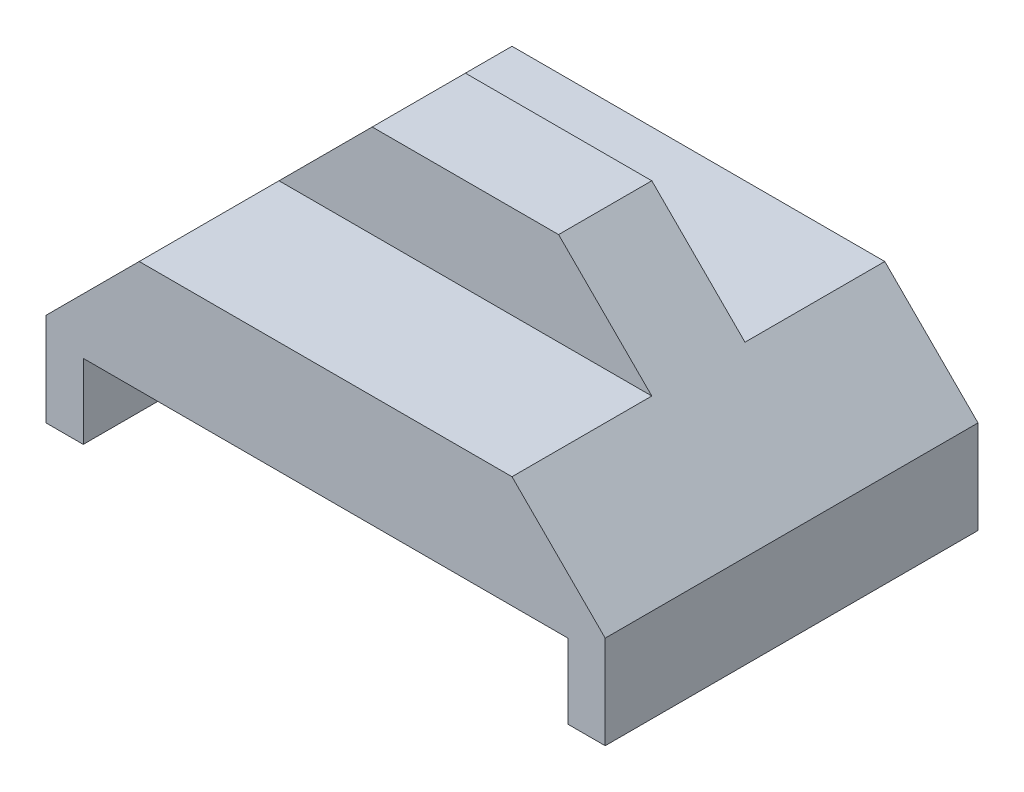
ISO-10303-21;
HEADER;
FILE_DESCRIPTION(('STEP AP214'),'2;1');
FILE_NAME('part.step','',(''),(''),'','','');
FILE_SCHEMA(('AUTOMOTIVE_DESIGN { 1 0 10303 214 1 1 1 1 }'));
ENDSEC;
DATA;
#1=APPLICATION_CONTEXT('core data for automotive mechanical design processes');
#2=APPLICATION_PROTOCOL_DEFINITION('international standard','automotive_design',2000,#1);
#3=PRODUCT_CONTEXT('',#1,'mechanical');
#4=PRODUCT('Part','Part','',(#3));
#5=PRODUCT_RELATED_PRODUCT_CATEGORY('part','',(#4));
#6=PRODUCT_DEFINITION_FORMATION('','',#4);
#7=PRODUCT_DEFINITION_CONTEXT('part definition',#1,'design');
#8=PRODUCT_DEFINITION('design','',#6,#7);
#9=PRODUCT_DEFINITION_SHAPE('','',#8);
#10=(LENGTH_UNIT() NAMED_UNIT(*) SI_UNIT(.MILLI.,.METRE.));
#11=(NAMED_UNIT(*) PLANE_ANGLE_UNIT() SI_UNIT($,.RADIAN.));
#12=(NAMED_UNIT(*) SI_UNIT($,.STERADIAN.) SOLID_ANGLE_UNIT());
#13=UNCERTAINTY_MEASURE_WITH_UNIT(LENGTH_MEASURE(1.E-05),#10,'distance_accuracy_value','');
#14=(GEOMETRIC_REPRESENTATION_CONTEXT(3) GLOBAL_UNCERTAINTY_ASSIGNED_CONTEXT((#13)) GLOBAL_UNIT_ASSIGNED_CONTEXT((#10,
#11,#12)) REPRESENTATION_CONTEXT('',''));
#15=CARTESIAN_POINT('',(0.,0.,0.));
#16=DIRECTION('',(0.,0.,1.));
#17=DIRECTION('',(1.,0.,0.));
#18=AXIS2_PLACEMENT_3D('',#15,#16,#17);
#19=CARTESIAN_POINT('',(0.,10.,0.));
#20=DIRECTION('',(0.,-1.,0.));
#21=DIRECTION('',(0.,0.,-1.));
#22=AXIS2_PLACEMENT_3D('',#19,#20,#21);
#23=PLANE('',#22);
#24=DIRECTION('',(1.,0.,0.));
#25=VECTOR('',#24,1.);
#26=CARTESIAN_POINT('',(25.,10.,-7.5));
#27=LINE('',#26,#25);
#28=CARTESIAN_POINT('',(4.99999999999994,10.,-7.5));
#29=VERTEX_POINT('',#28);
#30=CARTESIAN_POINT('',(25.,10.,-7.5));
#31=VERTEX_POINT('',#30);
#32=EDGE_CURVE('E48',#29,#31,#27,.T.);
#33=ORIENTED_EDGE('',*,*,#32,.F.);
#34=DIRECTION('',(0.,0.,1.));
#35=VECTOR('',#34,1.);
#36=CARTESIAN_POINT('',(4.99999999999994,10.,-20.));
#37=LINE('',#36,#35);
#38=CARTESIAN_POINT('',(4.99999999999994,10.,0.));
#39=VERTEX_POINT('',#38);
#40=EDGE_CURVE('E214',#29,#39,#37,.T.);
#41=ORIENTED_EDGE('',*,*,#40,.T.);
#42=DIRECTION('',(1.,0.,0.));
#43=VECTOR('',#42,1.);
#44=CARTESIAN_POINT('',(0.,10.,0.));
#45=LINE('',#44,#43);
#46=CARTESIAN_POINT('',(25.,10.,0.));
#47=VERTEX_POINT('',#46);
#48=EDGE_CURVE('E134',#39,#47,#45,.T.);
#49=ORIENTED_EDGE('',*,*,#48,.T.);
#50=DIRECTION('',(0.,0.,1.));
#51=VECTOR('',#50,1.);
#52=CARTESIAN_POINT('',(25.,10.,-20.));
#53=LINE('',#52,#51);
#54=EDGE_CURVE('E131',#31,#47,#53,.T.);
#55=ORIENTED_EDGE('',*,*,#54,.F.);
#56=EDGE_LOOP('',(#33,#41,#49,#55));
#57=FACE_BOUND('',#56,.T.);
#58=ADVANCED_FACE('F31',(#57),#23,.F.);
#59=CARTESIAN_POINT('',(0.,0.,0.));
#60=DIRECTION('',(0.,-1.,0.));
#61=DIRECTION('',(0.,0.,-1.));
#62=AXIS2_PLACEMENT_3D('',#59,#60,#61);
#63=PLANE('',#62);
#64=DIRECTION('',(0.,0.,1.));
#65=VECTOR('',#64,1.);
#66=CARTESIAN_POINT('',(2.,0.,-20.));
#67=LINE('',#66,#65);
#68=CARTESIAN_POINT('',(2.,0.,-20.));
#69=VERTEX_POINT('',#68);
#70=CARTESIAN_POINT('',(2.,0.,0.));
#71=VERTEX_POINT('',#70);
#72=EDGE_CURVE('E278',#69,#71,#67,.T.);
#73=ORIENTED_EDGE('',*,*,#72,.T.);
#74=DIRECTION('',(1.,0.,0.));
#75=VECTOR('',#74,1.);
#76=CARTESIAN_POINT('',(0.,0.,0.));
#77=LINE('',#76,#75);
#78=CARTESIAN_POINT('',(0.,0.,0.));
#79=VERTEX_POINT('',#78);
#80=EDGE_CURVE('E239',#79,#71,#77,.T.);
#81=ORIENTED_EDGE('',*,*,#80,.F.);
#82=DIRECTION('',(0.,0.,1.));
#83=VECTOR('',#82,1.);
#84=CARTESIAN_POINT('',(0.,0.,0.));
#85=LINE('',#84,#83);
#86=CARTESIAN_POINT('',(0.,0.,-20.));
#87=VERTEX_POINT('',#86);
#88=EDGE_CURVE('E230',#87,#79,#85,.T.);
#89=ORIENTED_EDGE('',*,*,#88,.F.);
#90=DIRECTION('',(-1.,0.,0.));
#91=VECTOR('',#90,1.);
#92=CARTESIAN_POINT('',(0.,0.,-20.));
#93=LINE('',#92,#91);
#94=EDGE_CURVE('E250',#69,#87,#93,.T.);
#95=ORIENTED_EDGE('',*,*,#94,.F.);
#96=EDGE_LOOP('',(#73,#81,#89,#95));
#97=FACE_BOUND('',#96,.T.);
#98=ADVANCED_FACE('F294',(#97),#63,.T.);
#99=CARTESIAN_POINT('',(0.,10.,0.));
#100=DIRECTION('',(1.,0.,0.));
#101=DIRECTION('',(0.,0.,-1.));
#102=AXIS2_PLACEMENT_3D('',#99,#100,#101);
#103=PLANE('',#102);
#104=DIRECTION('',(0.,-1.,0.));
#105=VECTOR('',#104,1.);
#106=CARTESIAN_POINT('',(0.,10.,0.));
#107=LINE('',#106,#105);
#108=CARTESIAN_POINT('',(0.,5.,0.));
#109=VERTEX_POINT('',#108);
#110=EDGE_CURVE('E11',#109,#79,#107,.T.);
#111=ORIENTED_EDGE('',*,*,#110,.F.);
#112=DIRECTION('',(0.,0.,1.));
#113=VECTOR('',#112,1.);
#114=CARTESIAN_POINT('',(0.,5.,-20.));
#115=LINE('',#114,#113);
#116=CARTESIAN_POINT('',(0.,5.,-20.));
#117=VERTEX_POINT('',#116);
#118=EDGE_CURVE('E207',#117,#109,#115,.T.);
#119=ORIENTED_EDGE('',*,*,#118,.F.);
#120=DIRECTION('',(0.,-1.,0.));
#121=VECTOR('',#120,1.);
#122=CARTESIAN_POINT('',(0.,10.,-20.));
#123=LINE('',#122,#121);
#124=EDGE_CURVE('E231',#117,#87,#123,.T.);
#125=ORIENTED_EDGE('',*,*,#124,.T.);
#126=ORIENTED_EDGE('',*,*,#88,.T.);
#127=EDGE_LOOP('',(#111,#119,#125,#126));
#128=FACE_BOUND('',#127,.T.);
#129=ADVANCED_FACE('F33',(#128),#103,.F.);
#130=CARTESIAN_POINT('',(0.,10.,0.));
#131=DIRECTION('',(0.,0.,-1.));
#132=DIRECTION('',(-1.,0.,0.));
#133=AXIS2_PLACEMENT_3D('',#130,#131,#132);
#134=PLANE('',#133);
#135=DIRECTION('',(0.,-1.,0.));
#136=VECTOR('',#135,1.);
#137=CARTESIAN_POINT('',(30.,10.,0.));
#138=LINE('',#137,#136);
#139=CARTESIAN_POINT('',(30.,5.,0.));
#140=VERTEX_POINT('',#139);
#141=CARTESIAN_POINT('',(30.,0.,0.));
#142=VERTEX_POINT('',#141);
#143=EDGE_CURVE('E40',#140,#142,#138,.T.);
#144=ORIENTED_EDGE('',*,*,#143,.F.);
#145=DIRECTION('',(0.707106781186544,-0.707106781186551,0.));
#146=VECTOR('',#145,1.);
#147=CARTESIAN_POINT('',(30.,5.,0.));
#148=LINE('',#147,#146);
#149=EDGE_CURVE('E274',#47,#140,#148,.T.);
#150=ORIENTED_EDGE('',*,*,#149,.F.);
#151=ORIENTED_EDGE('',*,*,#48,.F.);
#152=DIRECTION('',(0.707106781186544,0.707106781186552,0.));
#153=VECTOR('',#152,1.);
#154=CARTESIAN_POINT('',(0.,5.,0.));
#155=LINE('',#154,#153);
#156=EDGE_CURVE('E195',#109,#39,#155,.T.);
#157=ORIENTED_EDGE('',*,*,#156,.F.);
#158=ORIENTED_EDGE('',*,*,#110,.T.);
#159=ORIENTED_EDGE('',*,*,#80,.T.);
#160=DIRECTION('',(0.,-1.,0.));
#161=VECTOR('',#160,1.);
#162=CARTESIAN_POINT('',(2.,0.,0.));
#163=LINE('',#162,#161);
#164=CARTESIAN_POINT('',(2.,4.,0.));
#165=VERTEX_POINT('',#164);
#166=EDGE_CURVE('E215',#165,#71,#163,.T.);
#167=ORIENTED_EDGE('',*,*,#166,.F.);
#168=DIRECTION('',(-1.,0.,0.));
#169=VECTOR('',#168,1.);
#170=CARTESIAN_POINT('',(2.,4.,0.));
#171=LINE('',#170,#169);
#172=CARTESIAN_POINT('',(28.,4.,0.));
#173=VERTEX_POINT('',#172);
#174=EDGE_CURVE('E284',#173,#165,#171,.T.);
#175=ORIENTED_EDGE('',*,*,#174,.F.);
#176=DIRECTION('',(0.,1.,0.));
#177=VECTOR('',#176,1.);
#178=CARTESIAN_POINT('',(28.,0.,0.));
#179=LINE('',#178,#177);
#180=CARTESIAN_POINT('',(28.,0.,0.));
#181=VERTEX_POINT('',#180);
#182=EDGE_CURVE('E216',#181,#173,#179,.T.);
#183=ORIENTED_EDGE('',*,*,#182,.F.);
#184=EDGE_CURVE('E235',#181,#142,#77,.T.);
#185=ORIENTED_EDGE('',*,*,#184,.T.);
#186=EDGE_LOOP('',(#144,#150,#151,#157,#158,#159,#167,#175,#183,#185));
#187=FACE_BOUND('',#186,.T.);
#188=ADVANCED_FACE('F225',(#187),#134,.F.);
#189=CARTESIAN_POINT('',(30.,10.,0.));
#190=DIRECTION('',(-1.,0.,0.));
#191=DIRECTION('',(0.,0.,1.));
#192=AXIS2_PLACEMENT_3D('',#189,#190,#191);
#193=PLANE('',#192);
#194=DIRECTION('',(0.,-1.,0.));
#195=VECTOR('',#194,1.);
#196=CARTESIAN_POINT('',(30.,10.,-20.));
#197=LINE('',#196,#195);
#198=CARTESIAN_POINT('',(30.,5.,-20.));
#199=VERTEX_POINT('',#198);
#200=CARTESIAN_POINT('',(30.,0.,-20.));
#201=VERTEX_POINT('',#200);
#202=EDGE_CURVE('E255',#199,#201,#197,.T.);
#203=ORIENTED_EDGE('',*,*,#202,.F.);
#204=DIRECTION('',(0.,0.,1.));
#205=VECTOR('',#204,1.);
#206=CARTESIAN_POINT('',(30.,5.,-20.));
#207=LINE('',#206,#205);
#208=EDGE_CURVE('E192',#199,#140,#207,.T.);
#209=ORIENTED_EDGE('',*,*,#208,.T.);
#210=ORIENTED_EDGE('',*,*,#143,.T.);
#211=DIRECTION('',(0.,0.,-1.));
#212=VECTOR('',#211,1.);
#213=CARTESIAN_POINT('',(30.,0.,0.));
#214=LINE('',#213,#212);
#215=EDGE_CURVE('E247',#142,#201,#214,.T.);
#216=ORIENTED_EDGE('',*,*,#215,.T.);
#217=EDGE_LOOP('',(#203,#209,#210,#216));
#218=FACE_BOUND('',#217,.T.);
#219=ADVANCED_FACE('F258',(#218),#193,.F.);
#220=CARTESIAN_POINT('',(0.,10.,-20.));
#221=DIRECTION('',(0.,0.,1.));
#222=DIRECTION('',(1.,0.,0.));
#223=AXIS2_PLACEMENT_3D('',#220,#221,#222);
#224=PLANE('',#223);
#225=DIRECTION('',(-1.,0.,0.));
#226=VECTOR('',#225,1.);
#227=CARTESIAN_POINT('',(0.,10.,-20.));
#228=LINE('',#227,#226);
#229=CARTESIAN_POINT('',(25.,10.,-20.));
#230=VERTEX_POINT('',#229);
#231=CARTESIAN_POINT('',(4.99999999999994,10.,-20.));
#232=VERTEX_POINT('',#231);
#233=EDGE_CURVE('E244',#230,#232,#228,.T.);
#234=ORIENTED_EDGE('',*,*,#233,.F.);
#235=DIRECTION('',(0.707106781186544,-0.707106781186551,0.));
#236=VECTOR('',#235,1.);
#237=CARTESIAN_POINT('',(30.,5.,-20.));
#238=LINE('',#237,#236);
#239=EDGE_CURVE('E138',#230,#199,#238,.T.);
#240=ORIENTED_EDGE('',*,*,#239,.T.);
#241=ORIENTED_EDGE('',*,*,#202,.T.);
#242=CARTESIAN_POINT('',(28.,0.,-20.));
#243=VERTEX_POINT('',#242);
#244=EDGE_CURVE('E251',#201,#243,#93,.T.);
#245=ORIENTED_EDGE('',*,*,#244,.T.);
#246=DIRECTION('',(0.,1.,0.));
#247=VECTOR('',#246,1.);
#248=CARTESIAN_POINT('',(28.,0.,-20.));
#249=LINE('',#248,#247);
#250=CARTESIAN_POINT('',(28.,4.,-20.));
#251=VERTEX_POINT('',#250);
#252=EDGE_CURVE('E273',#243,#251,#249,.T.);
#253=ORIENTED_EDGE('',*,*,#252,.T.);
#254=DIRECTION('',(-1.,0.,0.));
#255=VECTOR('',#254,1.);
#256=CARTESIAN_POINT('',(2.,4.,-20.));
#257=LINE('',#256,#255);
#258=CARTESIAN_POINT('',(2.,4.,-20.));
#259=VERTEX_POINT('',#258);
#260=EDGE_CURVE('E281',#251,#259,#257,.T.);
#261=ORIENTED_EDGE('',*,*,#260,.T.);
#262=DIRECTION('',(0.,-1.,0.));
#263=VECTOR('',#262,1.);
#264=CARTESIAN_POINT('',(2.,0.,-20.));
#265=LINE('',#264,#263);
#266=EDGE_CURVE('E287',#259,#69,#265,.T.);
#267=ORIENTED_EDGE('',*,*,#266,.T.);
#268=ORIENTED_EDGE('',*,*,#94,.T.);
#269=ORIENTED_EDGE('',*,*,#124,.F.);
#270=DIRECTION('',(0.707106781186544,0.707106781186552,0.));
#271=VECTOR('',#270,1.);
#272=CARTESIAN_POINT('',(0.,5.,-20.));
#273=LINE('',#272,#271);
#274=EDGE_CURVE('E203',#117,#232,#273,.T.);
#275=ORIENTED_EDGE('',*,*,#274,.T.);
#276=EDGE_LOOP('',(#234,#240,#241,#245,#253,#261,#267,#268,#269,#275));
#277=FACE_BOUND('',#276,.T.);
#278=ADVANCED_FACE('F271',(#277),#224,.F.);
#279=CARTESIAN_POINT('',(4.99999999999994,10.,-12.5));
#280=VERTEX_POINT('',#279);
#281=EDGE_CURVE('E56',#232,#280,#37,.T.);
#282=ORIENTED_EDGE('',*,*,#281,.T.);
#283=DIRECTION('',(1.,0.,0.));
#284=VECTOR('',#283,1.);
#285=CARTESIAN_POINT('',(25.,10.,-12.5));
#286=LINE('',#285,#284);
#287=CARTESIAN_POINT('',(25.,10.,-12.5));
#288=VERTEX_POINT('',#287);
#289=EDGE_CURVE('E169',#280,#288,#286,.T.);
#290=ORIENTED_EDGE('',*,*,#289,.T.);
#291=EDGE_CURVE('E137',#230,#288,#53,.T.);
#292=ORIENTED_EDGE('',*,*,#291,.F.);
#293=ORIENTED_EDGE('',*,*,#233,.T.);
#294=EDGE_LOOP('',(#282,#290,#292,#293));
#295=FACE_BOUND('',#294,.T.);
#296=ADVANCED_FACE('F189',(#295),#23,.F.);
#297=DIRECTION('',(0.,0.,1.));
#298=VECTOR('',#297,1.);
#299=CARTESIAN_POINT('',(28.,0.,-20.));
#300=LINE('',#299,#298);
#301=EDGE_CURVE('E268',#243,#181,#300,.T.);
#302=ORIENTED_EDGE('',*,*,#301,.F.);
#303=ORIENTED_EDGE('',*,*,#244,.F.);
#304=ORIENTED_EDGE('',*,*,#215,.F.);
#305=ORIENTED_EDGE('',*,*,#184,.F.);
#306=EDGE_LOOP('',(#302,#303,#304,#305));
#307=FACE_BOUND('',#306,.T.);
#308=ADVANCED_FACE('F267',(#307),#63,.T.);
#309=CARTESIAN_POINT('',(2.,0.,-20.));
#310=DIRECTION('',(-1.,0.,0.));
#311=DIRECTION('',(0.,0.,1.));
#312=AXIS2_PLACEMENT_3D('',#309,#310,#311);
#313=PLANE('',#312);
#314=ORIENTED_EDGE('',*,*,#166,.T.);
#315=ORIENTED_EDGE('',*,*,#72,.F.);
#316=ORIENTED_EDGE('',*,*,#266,.F.);
#317=DIRECTION('',(0.,0.,1.));
#318=VECTOR('',#317,1.);
#319=CARTESIAN_POINT('',(2.,4.,-20.));
#320=LINE('',#319,#318);
#321=EDGE_CURVE('E236',#259,#165,#320,.T.);
#322=ORIENTED_EDGE('',*,*,#321,.T.);
#323=EDGE_LOOP('',(#314,#315,#316,#322));
#324=FACE_BOUND('',#323,.T.);
#325=ADVANCED_FACE('F296',(#324),#313,.F.);
#326=CARTESIAN_POINT('',(2.,4.,-20.));
#327=DIRECTION('',(0.,1.,0.));
#328=DIRECTION('',(0.,0.,1.));
#329=AXIS2_PLACEMENT_3D('',#326,#327,#328);
#330=PLANE('',#329);
#331=ORIENTED_EDGE('',*,*,#174,.T.);
#332=ORIENTED_EDGE('',*,*,#321,.F.);
#333=ORIENTED_EDGE('',*,*,#260,.F.);
#334=DIRECTION('',(0.,0.,1.));
#335=VECTOR('',#334,1.);
#336=CARTESIAN_POINT('',(28.,4.,-20.));
#337=LINE('',#336,#335);
#338=EDGE_CURVE('E241',#251,#173,#337,.T.);
#339=ORIENTED_EDGE('',*,*,#338,.T.);
#340=EDGE_LOOP('',(#331,#332,#333,#339));
#341=FACE_BOUND('',#340,.T.);
#342=ADVANCED_FACE('F298',(#341),#330,.F.);
#343=CARTESIAN_POINT('',(28.,0.,-20.));
#344=DIRECTION('',(1.,0.,0.));
#345=DIRECTION('',(0.,0.,-1.));
#346=AXIS2_PLACEMENT_3D('',#343,#344,#345);
#347=PLANE('',#346);
#348=ORIENTED_EDGE('',*,*,#182,.T.);
#349=ORIENTED_EDGE('',*,*,#338,.F.);
#350=ORIENTED_EDGE('',*,*,#252,.F.);
#351=ORIENTED_EDGE('',*,*,#301,.T.);
#352=EDGE_LOOP('',(#348,#349,#350,#351));
#353=FACE_BOUND('',#352,.T.);
#354=ADVANCED_FACE('F300',(#353),#347,.F.);
#355=CARTESIAN_POINT('',(0.,5.,-20.));
#356=DIRECTION('',(0.707106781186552,-0.707106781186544,0.));
#357=DIRECTION('',(0.707106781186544,0.707106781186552,0.));
#358=AXIS2_PLACEMENT_3D('',#355,#356,#357);
#359=PLANE('',#358);
#360=ORIENTED_EDGE('',*,*,#156,.T.);
#361=ORIENTED_EDGE('',*,*,#40,.F.);
#362=DIRECTION('',(-0.707106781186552,-0.707106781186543,0.));
#363=VECTOR('',#362,1.);
#364=CARTESIAN_POINT('',(4.99999999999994,10.,-7.5));
#365=LINE('',#364,#363);
#366=CARTESIAN_POINT('',(10.,15.,-7.5));
#367=VERTEX_POINT('',#366);
#368=EDGE_CURVE('E152',#367,#29,#365,.T.);
#369=ORIENTED_EDGE('',*,*,#368,.F.);
#370=DIRECTION('',(0.,0.,-1.));
#371=VECTOR('',#370,1.);
#372=CARTESIAN_POINT('',(10.,15.,-7.5));
#373=LINE('',#372,#371);
#374=CARTESIAN_POINT('',(10.,15.,-12.5));
#375=VERTEX_POINT('',#374);
#376=EDGE_CURVE('E180',#367,#375,#373,.T.);
#377=ORIENTED_EDGE('',*,*,#376,.T.);
#378=DIRECTION('',(-0.707106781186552,-0.707106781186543,0.));
#379=VECTOR('',#378,1.);
#380=CARTESIAN_POINT('',(4.99999999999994,10.,-12.5));
#381=LINE('',#380,#379);
#382=EDGE_CURVE('E153',#375,#280,#381,.T.);
#383=ORIENTED_EDGE('',*,*,#382,.T.);
#384=ORIENTED_EDGE('',*,*,#281,.F.);
#385=ORIENTED_EDGE('',*,*,#274,.F.);
#386=ORIENTED_EDGE('',*,*,#118,.T.);
#387=EDGE_LOOP('',(#360,#361,#369,#377,#383,#384,#385,#386));
#388=FACE_BOUND('',#387,.T.);
#389=ADVANCED_FACE('F185',(#388),#359,.F.);
#390=CARTESIAN_POINT('',(30.,5.,-20.));
#391=DIRECTION('',(-0.707106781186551,-0.707106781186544,0.));
#392=DIRECTION('',(0.707106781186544,-0.707106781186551,0.));
#393=AXIS2_PLACEMENT_3D('',#390,#391,#392);
#394=PLANE('',#393);
#395=ORIENTED_EDGE('',*,*,#149,.T.);
#396=ORIENTED_EDGE('',*,*,#208,.F.);
#397=ORIENTED_EDGE('',*,*,#239,.F.);
#398=ORIENTED_EDGE('',*,*,#291,.T.);
#399=DIRECTION('',(-0.707106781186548,0.707106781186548,0.));
#400=VECTOR('',#399,1.);
#401=CARTESIAN_POINT('',(20.,15.,-12.5));
#402=LINE('',#401,#400);
#403=CARTESIAN_POINT('',(20.,15.,-12.5));
#404=VERTEX_POINT('',#403);
#405=EDGE_CURVE('E171',#288,#404,#402,.T.);
#406=ORIENTED_EDGE('',*,*,#405,.T.);
#407=DIRECTION('',(0.,0.,-1.));
#408=VECTOR('',#407,1.);
#409=CARTESIAN_POINT('',(20.,15.,-7.5));
#410=LINE('',#409,#408);
#411=CARTESIAN_POINT('',(20.,15.,-7.5));
#412=VERTEX_POINT('',#411);
#413=EDGE_CURVE('E144',#412,#404,#410,.T.);
#414=ORIENTED_EDGE('',*,*,#413,.F.);
#415=DIRECTION('',(-0.707106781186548,0.707106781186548,0.));
#416=VECTOR('',#415,1.);
#417=CARTESIAN_POINT('',(20.,15.,-7.5));
#418=LINE('',#417,#416);
#419=EDGE_CURVE('E141',#31,#412,#418,.T.);
#420=ORIENTED_EDGE('',*,*,#419,.F.);
#421=ORIENTED_EDGE('',*,*,#54,.T.);
#422=EDGE_LOOP('',(#395,#396,#397,#398,#406,#414,#420,#421));
#423=FACE_BOUND('',#422,.T.);
#424=ADVANCED_FACE('F142',(#423),#394,.F.);
#425=CARTESIAN_POINT('',(10.,15.,-7.5));
#426=DIRECTION('',(0.,-1.,0.));
#427=DIRECTION('',(0.,0.,-1.));
#428=AXIS2_PLACEMENT_3D('',#425,#426,#427);
#429=PLANE('',#428);
#430=DIRECTION('',(-1.,0.,0.));
#431=VECTOR('',#430,1.);
#432=CARTESIAN_POINT('',(10.,15.,-12.5));
#433=LINE('',#432,#431);
#434=EDGE_CURVE('E155',#404,#375,#433,.T.);
#435=ORIENTED_EDGE('',*,*,#434,.T.);
#436=ORIENTED_EDGE('',*,*,#376,.F.);
#437=DIRECTION('',(-1.,0.,0.));
#438=VECTOR('',#437,1.);
#439=CARTESIAN_POINT('',(10.,15.,-7.5));
#440=LINE('',#439,#438);
#441=EDGE_CURVE('E147',#412,#367,#440,.T.);
#442=ORIENTED_EDGE('',*,*,#441,.F.);
#443=ORIENTED_EDGE('',*,*,#413,.T.);
#444=EDGE_LOOP('',(#435,#436,#442,#443));
#445=FACE_BOUND('',#444,.T.);
#446=ADVANCED_FACE('F179',(#445),#429,.F.);
#447=CARTESIAN_POINT('',(25.,10.,-7.5));
#448=DIRECTION('',(0.,0.,1.));
#449=DIRECTION('',(1.,0.,0.));
#450=AXIS2_PLACEMENT_3D('',#447,#448,#449);
#451=PLANE('',#450);
#452=ORIENTED_EDGE('',*,*,#32,.T.);
#453=ORIENTED_EDGE('',*,*,#419,.T.);
#454=ORIENTED_EDGE('',*,*,#441,.T.);
#455=ORIENTED_EDGE('',*,*,#368,.T.);
#456=EDGE_LOOP('',(#452,#453,#454,#455));
#457=FACE_BOUND('',#456,.T.);
#458=ADVANCED_FACE('F150',(#457),#451,.T.);
#459=CARTESIAN_POINT('',(25.,10.,-12.5));
#460=DIRECTION('',(0.,0.,1.));
#461=DIRECTION('',(1.,0.,0.));
#462=AXIS2_PLACEMENT_3D('',#459,#460,#461);
#463=PLANE('',#462);
#464=ORIENTED_EDGE('',*,*,#289,.F.);
#465=ORIENTED_EDGE('',*,*,#382,.F.);
#466=ORIENTED_EDGE('',*,*,#434,.F.);
#467=ORIENTED_EDGE('',*,*,#405,.F.);
#468=EDGE_LOOP('',(#464,#465,#466,#467));
#469=FACE_BOUND('',#468,.T.);
#470=ADVANCED_FACE('F187',(#469),#463,.F.);
#471=CLOSED_SHELL('',(#58,#98,#129,#188,#219,#278,#296,#308,#325,#342,#354,#389,#424,#446,#458,#470));
#472=MANIFOLD_SOLID_BREP('B2',#471);
#473=ADVANCED_BREP_SHAPE_REPRESENTATION('',(#18,#472),#14);
#474=SHAPE_DEFINITION_REPRESENTATION(#9,#473);
ENDSEC;
END-ISO-10303-21;
